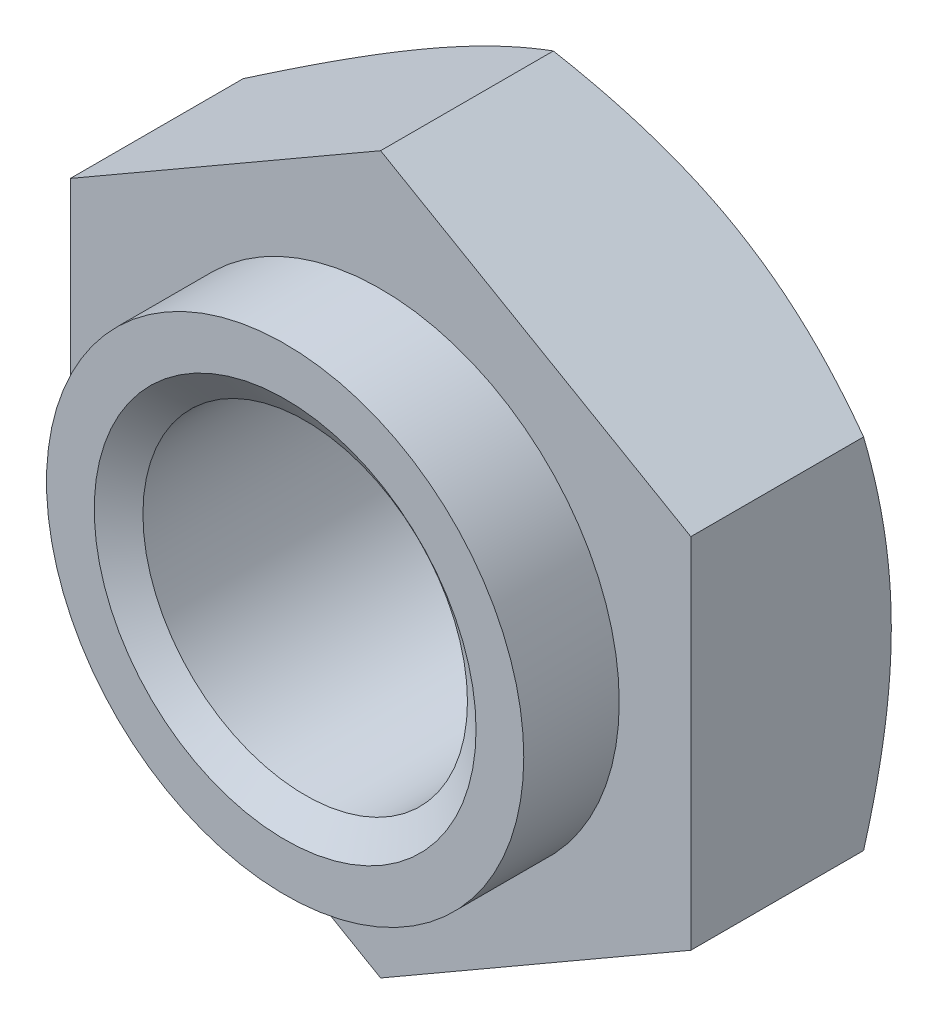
ISO-10303-21;
HEADER;
FILE_DESCRIPTION(('STEP AP214'),'2;1');
FILE_NAME('part.step','',(''),(''),'','','');
FILE_SCHEMA(('AUTOMOTIVE_DESIGN { 1 0 10303 214 1 1 1 1 }'));
ENDSEC;
DATA;
#1=APPLICATION_CONTEXT('core data for automotive mechanical design processes');
#2=APPLICATION_PROTOCOL_DEFINITION('international standard','automotive_design',2000,#1);
#3=PRODUCT_CONTEXT('',#1,'mechanical');
#4=PRODUCT('Part','Part','',(#3));
#5=PRODUCT_RELATED_PRODUCT_CATEGORY('part','',(#4));
#6=PRODUCT_DEFINITION_FORMATION('','',#4);
#7=PRODUCT_DEFINITION_CONTEXT('part definition',#1,'design');
#8=PRODUCT_DEFINITION('design','',#6,#7);
#9=PRODUCT_DEFINITION_SHAPE('','',#8);
#10=(LENGTH_UNIT() NAMED_UNIT(*) SI_UNIT(.MILLI.,.METRE.));
#11=(NAMED_UNIT(*) PLANE_ANGLE_UNIT() SI_UNIT($,.RADIAN.));
#12=(NAMED_UNIT(*) SI_UNIT($,.STERADIAN.) SOLID_ANGLE_UNIT());
#13=UNCERTAINTY_MEASURE_WITH_UNIT(LENGTH_MEASURE(1.E-05),#10,'distance_accuracy_value','');
#14=(GEOMETRIC_REPRESENTATION_CONTEXT(3) GLOBAL_UNCERTAINTY_ASSIGNED_CONTEXT((#13)) GLOBAL_UNIT_ASSIGNED_CONTEXT((#10,
#11,#12)) REPRESENTATION_CONTEXT('',''));
#15=CARTESIAN_POINT('',(0.,0.,0.));
#16=DIRECTION('',(0.,0.,1.));
#17=DIRECTION('',(1.,0.,0.));
#18=AXIS2_PLACEMENT_3D('',#15,#16,#17);
#19=CARTESIAN_POINT('',(0.,7.50555349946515,0.));
#20=DIRECTION('',(0.,0.,-1.));
#21=DIRECTION('',(-1.,0.,0.));
#22=AXIS2_PLACEMENT_3D('',#19,#20,#21);
#23=PLANE('',#22);
#24=CARTESIAN_POINT('',(0.,0.,0.));
#25=DIRECTION('',(0.,0.,1.));
#26=DIRECTION('',(1.,0.,0.));
#27=AXIS2_PLACEMENT_3D('',#24,#25,#26);
#28=CIRCLE('',#27,4.);
#29=CARTESIAN_POINT('',(4.,0.,0.));
#30=VERTEX_POINT('',#29);
#31=EDGE_CURVE('E146',#30,#30,#28,.T.);
#32=ORIENTED_EDGE('',*,*,#31,.F.);
#33=EDGE_LOOP('',(#32));
#34=FACE_BOUND('',#33,.T.);
#35=CARTESIAN_POINT('',(0.,0.,0.));
#36=DIRECTION('',(0.,0.,1.));
#37=DIRECTION('',(1.,0.,0.));
#38=AXIS2_PLACEMENT_3D('',#35,#36,#37);
#39=CIRCLE('',#38,5.);
#40=CARTESIAN_POINT('',(5.,0.,0.));
#41=VERTEX_POINT('',#40);
#42=EDGE_CURVE('E248',#41,#41,#39,.T.);
#43=ORIENTED_EDGE('',*,*,#42,.T.);
#44=EDGE_LOOP('',(#43));
#45=FACE_BOUND('',#44,.T.);
#46=ADVANCED_FACE('F35',(#34,#45),#23,.F.);
#47=CARTESIAN_POINT('',(0.,7.50555349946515,-6.2));
#48=DIRECTION('',(-0.500000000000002,0.866025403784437,0.));
#49=DIRECTION('',(-0.866025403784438,-0.500000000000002,0.));
#50=AXIS2_PLACEMENT_3D('',#47,#48,#49);
#51=PLANE('',#50);
#52=DIRECTION('',(0.,0.,1.));
#53=VECTOR('',#52,1.);
#54=CARTESIAN_POINT('',(-6.5,3.75277674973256,-6.2));
#55=LINE('',#54,#53);
#56=CARTESIAN_POINT('',(-6.5,3.7527767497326,-5.61944341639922));
#57=VERTEX_POINT('',#56);
#58=CARTESIAN_POINT('',(-6.5,3.75277674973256,-2.));
#59=VERTEX_POINT('',#58);
#60=EDGE_CURVE('E129',#57,#59,#55,.T.);
#61=ORIENTED_EDGE('',*,*,#60,.T.);
#62=DIRECTION('',(0.866025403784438,0.500000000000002,0.));
#63=VECTOR('',#62,1.);
#64=CARTESIAN_POINT('',(0.,7.50555349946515,-2.));
#65=LINE('',#64,#63);
#66=CARTESIAN_POINT('',(0.,7.50555349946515,-2.));
#67=VERTEX_POINT('',#66);
#68=EDGE_CURVE('E51',#59,#67,#65,.T.);
#69=ORIENTED_EDGE('',*,*,#68,.T.);
#70=DIRECTION('',(0.,0.,1.));
#71=VECTOR('',#70,1.);
#72=CARTESIAN_POINT('',(0.,7.50555349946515,-6.2));
#73=LINE('',#72,#71);
#74=CARTESIAN_POINT('',(0.,7.50555349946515,-5.61944341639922));
#75=VERTEX_POINT('',#74);
#76=EDGE_CURVE('E141',#75,#67,#73,.T.);
#77=ORIENTED_EDGE('',*,*,#76,.F.);
#78=CARTESIAN_POINT('',(-6.5002,3.75266127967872,-5.61937674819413));
#79=CARTESIAN_POINT('',(-6.35732254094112,3.83515161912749,-5.66699557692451));
#80=CARTESIAN_POINT('',(-6.21391236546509,3.91794952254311,-5.71245329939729));
#81=CARTESIAN_POINT('',(-5.9259273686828,4.08421773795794,-5.79845131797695));
#82=CARTESIAN_POINT('',(-5.78135207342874,4.16768832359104,-5.83898949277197));
#83=CARTESIAN_POINT('',(-5.34531134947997,4.41943655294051,-5.95242899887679));
#84=CARTESIAN_POINT('',(-5.05212471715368,4.58870793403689,-6.01695219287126));
#85=CARTESIAN_POINT('',(-4.61337625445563,4.84201947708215,-6.09261341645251));
#86=CARTESIAN_POINT('',(-4.46912536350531,4.92530276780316,-6.11416714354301));
#87=CARTESIAN_POINT('',(-4.17997178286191,5.09224566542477,-6.15030968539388));
#88=CARTESIAN_POINT('',(-4.03506915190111,5.17590523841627,-6.16489911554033));
#89=CARTESIAN_POINT('',(-3.74501222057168,5.34336968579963,-6.18674124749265));
#90=CARTESIAN_POINT('',(-3.59985839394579,5.427174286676,-6.19400227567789));
#91=CARTESIAN_POINT('',(-3.30942466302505,5.59485627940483,-6.20103969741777));
#92=CARTESIAN_POINT('',(-3.16414476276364,5.6787336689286,-6.2008163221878));
#93=CARTESIAN_POINT('',(-2.76612405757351,5.90853103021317,-6.18991654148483));
#94=CARTESIAN_POINT('',(-2.51351353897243,6.05437578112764,-6.17161818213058));
#95=CARTESIAN_POINT('',(-2.00997032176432,6.34509659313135,-6.11359365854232));
#96=CARTESIAN_POINT('',(-1.75903939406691,6.48997163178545,-6.07384766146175));
#97=CARTESIAN_POINT('',(-1.25448277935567,6.78127752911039,-5.97449409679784));
#98=CARTESIAN_POINT('',(-1.00092075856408,6.92767163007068,-5.91446557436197));
#99=CARTESIAN_POINT('',(-0.497578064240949,7.21827667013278,-5.77822500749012));
#100=CARTESIAN_POINT('',(-0.247790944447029,7.3624913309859,-5.7020449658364));
#101=CARTESIAN_POINT('',(0.000200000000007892,7.50566896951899,-5.61937674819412));
#102=B_SPLINE_CURVE_WITH_KNOTS('',3,(#78,#79,#80,#81,#82,#83,#84,#85,#86,#87,#88,#89,#90,#91,
#92,#93,#94,#95,#96,#97,#98,#99,#100,#101),.UNSPECIFIED.,.F.,.F.,(4,2,2,2,2,2,2,2,2,2,2,4),(0.,
0.515105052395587,1.03043143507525,2.06322554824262,2.56697389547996,3.07067772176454,
3.57380860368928,4.0769239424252,4.95279354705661,5.82947446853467,6.72559912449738,
7.61996451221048),.UNSPECIFIED.);
#103=CARTESIAN_POINT('',(-3.25000000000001,5.62916512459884,-6.2));
#104=VERTEX_POINT('',#103);
#105=EDGE_CURVE('E133',#104,#75,#102,.T.);
#106=ORIENTED_EDGE('',*,*,#105,.F.);
#107=EDGE_CURVE('E206',#57,#104,#102,.T.);
#108=ORIENTED_EDGE('',*,*,#107,.F.);
#109=EDGE_LOOP('',(#61,#69,#77,#106,#108));
#110=FACE_BOUND('',#109,.T.);
#111=ADVANCED_FACE('F37',(#110),#51,.T.);
#112=CARTESIAN_POINT('',(6.5,3.75277674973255,-6.2));
#113=DIRECTION('',(0.500000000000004,0.866025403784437,0.));
#114=DIRECTION('',(-0.866025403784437,0.500000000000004,0.));
#115=AXIS2_PLACEMENT_3D('',#112,#113,#114);
#116=PLANE('',#115);
#117=ORIENTED_EDGE('',*,*,#76,.T.);
#118=DIRECTION('',(0.866025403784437,-0.500000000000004,0.));
#119=VECTOR('',#118,1.);
#120=CARTESIAN_POINT('',(6.5,3.75277674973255,-2.));
#121=LINE('',#120,#119);
#122=CARTESIAN_POINT('',(6.5,3.75277674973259,-2.));
#123=VERTEX_POINT('',#122);
#124=EDGE_CURVE('E257',#67,#123,#121,.T.);
#125=ORIENTED_EDGE('',*,*,#124,.T.);
#126=DIRECTION('',(0.,0.,1.));
#127=VECTOR('',#126,1.);
#128=CARTESIAN_POINT('',(6.5,3.75277674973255,-6.2));
#129=LINE('',#128,#127);
#130=CARTESIAN_POINT('',(6.5,3.75277674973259,-5.61944341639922));
#131=VERTEX_POINT('',#130);
#132=EDGE_CURVE('E430',#131,#123,#129,.T.);
#133=ORIENTED_EDGE('',*,*,#132,.F.);
#134=CARTESIAN_POINT('',(-0.000199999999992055,7.50566896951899,-5.61937674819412));
#135=CARTESIAN_POINT('',(0.142677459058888,7.42317863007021,-5.6669955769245));
#136=CARTESIAN_POINT('',(0.286087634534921,7.34038072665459,-5.71245329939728));
#137=CARTESIAN_POINT('',(0.574072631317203,7.17411251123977,-5.79845131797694));
#138=CARTESIAN_POINT('',(0.718647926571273,7.09064192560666,-5.83898949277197));
#139=CARTESIAN_POINT('',(1.15468865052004,6.8388936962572,-5.95242899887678));
#140=CARTESIAN_POINT('',(1.44787528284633,6.66962231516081,-6.01695219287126));
#141=CARTESIAN_POINT('',(1.88662374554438,6.41631077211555,-6.0926134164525));
#142=CARTESIAN_POINT('',(2.0308746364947,6.33302748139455,-6.11416714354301));
#143=CARTESIAN_POINT('',(2.3200282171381,6.16608458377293,-6.15030968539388));
#144=CARTESIAN_POINT('',(2.4649308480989,6.08242501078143,-6.16489911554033));
#145=CARTESIAN_POINT('',(2.75498777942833,5.91496056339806,-6.18674124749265));
#146=CARTESIAN_POINT('',(2.90014160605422,5.8311559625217,-6.19400227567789));
#147=CARTESIAN_POINT('',(3.19057533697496,5.66347396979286,-6.20103969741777));
#148=CARTESIAN_POINT('',(3.33585523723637,5.5795965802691,-6.2008163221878));
#149=CARTESIAN_POINT('',(3.7338759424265,5.34979921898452,-6.18991654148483));
#150=CARTESIAN_POINT('',(3.98648646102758,5.20395446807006,-6.17161818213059));
#151=CARTESIAN_POINT('',(4.49002967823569,4.91323365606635,-6.11359365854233));
#152=CARTESIAN_POINT('',(4.74096060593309,4.76835861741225,-6.07384766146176));
#153=CARTESIAN_POINT('',(5.24551722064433,4.4770527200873,-5.97449409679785));
#154=CARTESIAN_POINT('',(5.49907924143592,4.33065861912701,-5.91446557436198));
#155=CARTESIAN_POINT('',(6.00242193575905,4.04005357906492,-5.77822500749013));
#156=CARTESIAN_POINT('',(6.25220905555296,3.8958389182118,-5.70204496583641));
#157=CARTESIAN_POINT('',(6.5002,3.75266127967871,-5.61937674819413));
#158=B_SPLINE_CURVE_WITH_KNOTS('',3,(#134,#135,#136,#137,#138,#139,#140,#141,#142,#143,#144,
#145,#146,#147,#148,#149,#150,#151,#152,#153,#154,#155,#156,#157),.UNSPECIFIED.,.F.,.F.,(4,2,2,
2,2,2,2,2,2,2,2,4),(0.,0.515105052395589,1.03043143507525,2.06322554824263,2.56697389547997,
3.07067772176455,3.57380860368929,4.07692394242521,4.95279354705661,5.82947446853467,
6.72559912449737,7.61996451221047),.UNSPECIFIED.);
#159=CARTESIAN_POINT('',(3.25000000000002,5.62916512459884,-6.2));
#160=VERTEX_POINT('',#159);
#161=EDGE_CURVE('E212',#160,#131,#158,.T.);
#162=ORIENTED_EDGE('',*,*,#161,.F.);
#163=EDGE_CURVE('E218',#75,#160,#158,.T.);
#164=ORIENTED_EDGE('',*,*,#163,.F.);
#165=EDGE_LOOP('',(#117,#125,#133,#162,#164));
#166=FACE_BOUND('',#165,.T.);
#167=ADVANCED_FACE('F220',(#166),#116,.T.);
#168=CARTESIAN_POINT('',(6.5,3.75277674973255,-6.2));
#169=DIRECTION('',(-1.,0.,0.));
#170=DIRECTION('',(0.,0.,1.));
#171=AXIS2_PLACEMENT_3D('',#168,#169,#170);
#172=PLANE('',#171);
#173=DIRECTION('',(0.,1.,0.));
#174=VECTOR('',#173,1.);
#175=CARTESIAN_POINT('',(6.5,3.75277674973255,-2.));
#176=LINE('',#175,#174);
#177=CARTESIAN_POINT('',(6.5,-3.7527767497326,-2.));
#178=VERTEX_POINT('',#177);
#179=EDGE_CURVE('E255',#178,#123,#176,.T.);
#180=ORIENTED_EDGE('',*,*,#179,.F.);
#181=DIRECTION('',(0.,0.,1.));
#182=VECTOR('',#181,1.);
#183=CARTESIAN_POINT('',(6.5,-3.7527767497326,-6.2));
#184=LINE('',#183,#182);
#185=CARTESIAN_POINT('',(6.5,-3.7527767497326,-5.61944341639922));
#186=VERTEX_POINT('',#185);
#187=EDGE_CURVE('E131',#186,#178,#184,.T.);
#188=ORIENTED_EDGE('',*,*,#187,.F.);
#189=CARTESIAN_POINT('',(6.5,-9.95291698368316,-3.08957641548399));
#190=CARTESIAN_POINT('',(6.5,-9.66753022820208,-3.22749106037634));
#191=CARTESIAN_POINT('',(6.5,-9.38146872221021,-3.36403471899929));
#192=CARTESIAN_POINT('',(6.5,-8.80763137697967,-3.63359663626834));
#193=CARTESIAN_POINT('',(6.5,-8.51985525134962,-3.76661428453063));
#194=CARTESIAN_POINT('',(6.5,-7.94066929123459,-4.02904149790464));
#195=CARTESIAN_POINT('',(6.5,-7.64924808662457,-4.15842605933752));
#196=CARTESIAN_POINT('',(6.5,-7.06401043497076,-4.41163779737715));
#197=CARTESIAN_POINT('',(6.5,-6.77019411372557,-4.53546526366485));
#198=CARTESIAN_POINT('',(6.5,-6.1760515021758,-4.77755519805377));
#199=CARTESIAN_POINT('',(6.5,-5.87568957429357,-4.89573068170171));
#200=CARTESIAN_POINT('',(6.5,-5.27142269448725,-5.12282610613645));
#201=CARTESIAN_POINT('',(6.5,-4.96751735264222,-5.231745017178));
#202=CARTESIAN_POINT('',(6.5,-4.35630541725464,-5.43740097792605));
#203=CARTESIAN_POINT('',(6.5,-4.04900762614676,-5.53416392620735));
#204=CARTESIAN_POINT('',(6.5,-3.43004022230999,-5.71236428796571));
#205=CARTESIAN_POINT('',(6.5,-3.11837202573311,-5.79380654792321));
#206=CARTESIAN_POINT('',(6.5,-2.49046594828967,-5.93741591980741));
#207=CARTESIAN_POINT('',(6.5,-2.17422687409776,-5.99957789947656));
#208=CARTESIAN_POINT('',(6.5,-1.53789167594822,-6.10042577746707));
#209=CARTESIAN_POINT('',(6.5,-1.21779554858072,-6.13911165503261));
#210=CARTESIAN_POINT('',(6.5,-0.737141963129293,-6.177053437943));
#211=CARTESIAN_POINT('',(6.5,-0.577336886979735,-6.18635478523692));
#212=CARTESIAN_POINT('',(6.5,-0.257468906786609,-6.19818591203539));
#213=CARTESIAN_POINT('',(6.5,-0.0974060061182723,-6.20071577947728));
#214=CARTESIAN_POINT('',(6.5,0.222635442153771,-6.19893598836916));
#215=CARTESIAN_POINT('',(6.5,0.382614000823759,-6.19462824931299));
#216=CARTESIAN_POINT('',(6.5,0.70225063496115,-6.17928241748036));
#217=CARTESIAN_POINT('',(6.5,0.861908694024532,-6.16824398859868));
#218=CARTESIAN_POINT('',(6.5,1.24887053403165,-6.13356313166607));
#219=CARTESIAN_POINT('',(6.5,1.47587694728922,-6.10654812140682));
#220=CARTESIAN_POINT('',(6.5,1.92815030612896,-6.04041011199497));
#221=CARTESIAN_POINT('',(6.5,2.15341675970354,-6.0012838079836));
#222=CARTESIAN_POINT('',(6.5,2.60202427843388,-5.9123108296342));
#223=CARTESIAN_POINT('',(6.5,2.82536331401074,-5.86245401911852));
#224=CARTESIAN_POINT('',(6.5,3.26974354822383,-5.75354123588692));
#225=CARTESIAN_POINT('',(6.5,3.49078496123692,-5.69448612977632));
#226=CARTESIAN_POINT('',(6.5,3.93601414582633,-5.56704588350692));
#227=CARTESIAN_POINT('',(6.5,4.16014622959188,-5.49846752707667));
#228=CARTESIAN_POINT('',(6.5,4.60604131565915,-5.35453487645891));
#229=CARTESIAN_POINT('',(6.5,4.82780583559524,-5.27918525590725));
#230=CARTESIAN_POINT('',(6.5,5.26807593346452,-5.12326649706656));
#231=CARTESIAN_POINT('',(6.5,5.48659282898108,-5.04272912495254));
#232=CARTESIAN_POINT('',(6.5,5.92193123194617,-4.87692729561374));
#233=CARTESIAN_POINT('',(6.5,6.13875201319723,-4.79166092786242));
#234=CARTESIAN_POINT('',(6.5,6.35478510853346,-4.70449786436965));
#235=B_SPLINE_CURVE_WITH_KNOTS('',3,(#189,#190,#191,#192,#193,#194,#195,#196,#197,#198,#199,
#200,#201,#202,#203,#204,#205,#206,#207,#208,#209,#210,#211,#212,#213,#214,#215,#216,#217,#218,
#219,#220,#221,#222,#223,#224,#225,#226,#227,#228,#229,#230,#231,#232,#233,#234),.UNSPECIFIED.,
.F.,.F.,(4,2,2,2,2,2,2,2,2,2,2,2,2,2,2,2,2,2,2,2,2,2,4),(0.,0.950904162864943,1.90197187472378,
2.85848216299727,3.81494253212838,4.78314526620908,5.75145556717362,6.71766655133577,
7.6835713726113,8.64973308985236,9.61589566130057,10.0960003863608,10.5760988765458,
11.0560626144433,11.5360503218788,12.2214931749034,12.9071232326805,13.5934038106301,
14.2796197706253,14.9826563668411,15.6852113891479,16.3838119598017,17.082696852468),.UNSPECIFIED.);
#236=CARTESIAN_POINT('',(6.5,0.,-6.2));
#237=VERTEX_POINT('',#236);
#238=EDGE_CURVE('E200',#186,#237,#235,.T.);
#239=ORIENTED_EDGE('',*,*,#238,.T.);
#240=EDGE_CURVE('E211',#237,#131,#235,.T.);
#241=ORIENTED_EDGE('',*,*,#240,.T.);
#242=ORIENTED_EDGE('',*,*,#132,.T.);
#243=EDGE_LOOP('',(#180,#188,#239,#241,#242));
#244=FACE_BOUND('',#243,.T.);
#245=ADVANCED_FACE('F224',(#244),#172,.F.);
#246=CARTESIAN_POINT('',(0.,-7.50555349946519,-6.2));
#247=DIRECTION('',(0.500000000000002,-0.866025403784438,0.));
#248=DIRECTION('',(0.866025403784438,0.500000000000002,0.));
#249=AXIS2_PLACEMENT_3D('',#246,#247,#248);
#250=PLANE('',#249);
#251=ORIENTED_EDGE('',*,*,#187,.T.);
#252=DIRECTION('',(-0.866025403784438,-0.500000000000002,0.));
#253=VECTOR('',#252,1.);
#254=CARTESIAN_POINT('',(0.,-7.50555349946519,-2.));
#255=LINE('',#254,#253);
#256=CARTESIAN_POINT('',(0.,-7.50555349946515,-2.));
#257=VERTEX_POINT('',#256);
#258=EDGE_CURVE('E121',#178,#257,#255,.T.);
#259=ORIENTED_EDGE('',*,*,#258,.T.);
#260=DIRECTION('',(0.,0.,1.));
#261=VECTOR('',#260,1.);
#262=CARTESIAN_POINT('',(0.,-7.50555349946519,-6.2));
#263=LINE('',#262,#261);
#264=CARTESIAN_POINT('',(0.,-7.50555349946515,-5.61944341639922));
#265=VERTEX_POINT('',#264);
#266=EDGE_CURVE('E120',#265,#257,#263,.T.);
#267=ORIENTED_EDGE('',*,*,#266,.F.);
#268=CARTESIAN_POINT('',(6.5002,-3.75266127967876,-5.61937674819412));
#269=CARTESIAN_POINT('',(6.35732254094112,-3.83515161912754,-5.6669955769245));
#270=CARTESIAN_POINT('',(6.21391236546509,-3.91794952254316,-5.71245329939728));
#271=CARTESIAN_POINT('',(5.92592736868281,-4.08421773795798,-5.79845131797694));
#272=CARTESIAN_POINT('',(5.78135207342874,-4.16768832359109,-5.83898949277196));
#273=CARTESIAN_POINT('',(5.34531134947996,-4.41943655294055,-5.95242899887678));
#274=CARTESIAN_POINT('',(5.05212471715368,-4.58870793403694,-6.01695219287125));
#275=CARTESIAN_POINT('',(4.61337625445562,-4.84201947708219,-6.09261341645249));
#276=CARTESIAN_POINT('',(4.4691253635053,-4.9253027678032,-6.114167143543));
#277=CARTESIAN_POINT('',(4.17997178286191,-5.09224566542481,-6.15030968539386));
#278=CARTESIAN_POINT('',(4.0350691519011,-5.17590523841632,-6.16489911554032));
#279=CARTESIAN_POINT('',(3.74501222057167,-5.34336968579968,-6.18674124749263));
#280=CARTESIAN_POINT('',(3.59985839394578,-5.42717428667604,-6.19400227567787));
#281=CARTESIAN_POINT('',(3.30942466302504,-5.59485627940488,-6.20103969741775));
#282=CARTESIAN_POINT('',(3.16414476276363,-5.67873366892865,-6.20081632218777));
#283=CARTESIAN_POINT('',(2.7661240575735,-5.90853103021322,-6.18991654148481));
#284=CARTESIAN_POINT('',(2.51351353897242,-6.05437578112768,-6.17161818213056));
#285=CARTESIAN_POINT('',(2.00997032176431,-6.3450965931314,-6.1135936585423));
#286=CARTESIAN_POINT('',(1.75903939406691,-6.48997163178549,-6.07384766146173));
#287=CARTESIAN_POINT('',(1.25448277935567,-6.78127752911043,-5.97449409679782));
#288=CARTESIAN_POINT('',(1.00092075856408,-6.92767163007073,-5.91446557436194));
#289=CARTESIAN_POINT('',(0.497578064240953,-7.21827667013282,-5.7782250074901));
#290=CARTESIAN_POINT('',(0.247790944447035,-7.36249133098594,-5.70204496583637));
#291=CARTESIAN_POINT('',(-0.000200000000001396,-7.50566896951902,-5.6193767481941));
#292=B_SPLINE_CURVE_WITH_KNOTS('',3,(#268,#269,#270,#271,#272,#273,#274,#275,#276,#277,#278,
#279,#280,#281,#282,#283,#284,#285,#286,#287,#288,#289,#290,#291),.UNSPECIFIED.,.F.,.F.,(4,2,2,
2,2,2,2,2,2,2,2,4),(0.,0.51510505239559,1.03043143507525,2.06322554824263,2.56697389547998,
3.07067772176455,3.57380860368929,4.07692394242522,4.95279354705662,5.82947446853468,
6.72559912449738,7.61996451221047),.UNSPECIFIED.);
#293=CARTESIAN_POINT('',(3.25000000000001,-5.62916512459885,-6.2));
#294=VERTEX_POINT('',#293);
#295=EDGE_CURVE('E194',#294,#265,#292,.T.);
#296=ORIENTED_EDGE('',*,*,#295,.F.);
#297=EDGE_CURVE('E422',#186,#294,#292,.T.);
#298=ORIENTED_EDGE('',*,*,#297,.F.);
#299=EDGE_LOOP('',(#251,#259,#267,#296,#298));
#300=FACE_BOUND('',#299,.T.);
#301=ADVANCED_FACE('F229',(#300),#250,.T.);
#302=CARTESIAN_POINT('',(-6.5,-3.75277674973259,-6.2));
#303=DIRECTION('',(-0.500000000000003,-0.866025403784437,0.));
#304=DIRECTION('',(0.866025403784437,-0.500000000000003,0.));
#305=AXIS2_PLACEMENT_3D('',#302,#303,#304);
#306=PLANE('',#305);
#307=ORIENTED_EDGE('',*,*,#266,.T.);
#308=DIRECTION('',(-0.866025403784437,0.500000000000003,0.));
#309=VECTOR('',#308,1.);
#310=CARTESIAN_POINT('',(-6.5,-3.75277674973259,-2.));
#311=LINE('',#310,#309);
#312=CARTESIAN_POINT('',(-6.5,-3.7527767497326,-2.));
#313=VERTEX_POINT('',#312);
#314=EDGE_CURVE('E107',#257,#313,#311,.T.);
#315=ORIENTED_EDGE('',*,*,#314,.T.);
#316=DIRECTION('',(0.,0.,1.));
#317=VECTOR('',#316,1.);
#318=CARTESIAN_POINT('',(-6.5,-3.75277674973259,-6.2));
#319=LINE('',#318,#317);
#320=CARTESIAN_POINT('',(-6.5,-3.7527767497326,-5.61944341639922));
#321=VERTEX_POINT('',#320);
#322=EDGE_CURVE('E118',#321,#313,#319,.T.);
#323=ORIENTED_EDGE('',*,*,#322,.F.);
#324=CARTESIAN_POINT('',(0.00019999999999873,-7.50566896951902,-5.6193767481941));
#325=CARTESIAN_POINT('',(-0.142677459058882,-7.42317863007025,-5.66699557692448));
#326=CARTESIAN_POINT('',(-0.286087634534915,-7.34038072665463,-5.71245329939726));
#327=CARTESIAN_POINT('',(-0.574072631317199,-7.1741125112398,-5.79845131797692));
#328=CARTESIAN_POINT('',(-0.718647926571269,-7.0906419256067,-5.83898949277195));
#329=CARTESIAN_POINT('',(-1.15468865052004,-6.83889369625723,-5.95242899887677));
#330=CARTESIAN_POINT('',(-1.44787528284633,-6.66962231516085,-6.01695219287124));
#331=CARTESIAN_POINT('',(-1.88662374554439,-6.41631077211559,-6.09261341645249));
#332=CARTESIAN_POINT('',(-2.0308746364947,-6.33302748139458,-6.11416714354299));
#333=CARTESIAN_POINT('',(-2.3200282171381,-6.16608458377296,-6.15030968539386));
#334=CARTESIAN_POINT('',(-2.4649308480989,-6.08242501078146,-6.16489911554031));
#335=CARTESIAN_POINT('',(-2.75498777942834,-5.91496056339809,-6.18674124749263));
#336=CARTESIAN_POINT('',(-2.90014160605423,-5.83115596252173,-6.19400227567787));
#337=CARTESIAN_POINT('',(-3.19057533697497,-5.66347396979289,-6.20103969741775));
#338=CARTESIAN_POINT('',(-3.33585523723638,-5.57959658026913,-6.20081632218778));
#339=CARTESIAN_POINT('',(-3.73387594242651,-5.34979921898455,-6.18991654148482));
#340=CARTESIAN_POINT('',(-3.98648646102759,-5.20395446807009,-6.17161818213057));
#341=CARTESIAN_POINT('',(-4.49002967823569,-4.91323365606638,-6.11359365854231));
#342=CARTESIAN_POINT('',(-4.74096060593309,-4.76835861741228,-6.07384766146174));
#343=CARTESIAN_POINT('',(-5.24551722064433,-4.47705272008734,-5.97449409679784));
#344=CARTESIAN_POINT('',(-5.49907924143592,-4.33065861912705,-5.91446557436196));
#345=CARTESIAN_POINT('',(-6.00242193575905,-4.04005357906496,-5.77822500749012));
#346=CARTESIAN_POINT('',(-6.25220905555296,-3.89583891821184,-5.7020449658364));
#347=CARTESIAN_POINT('',(-6.5002,-3.75266127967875,-5.61937674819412));
#348=B_SPLINE_CURVE_WITH_KNOTS('',3,(#324,#325,#326,#327,#328,#329,#330,#331,#332,#333,#334,
#335,#336,#337,#338,#339,#340,#341,#342,#343,#344,#345,#346,#347),.UNSPECIFIED.,.F.,.F.,(4,2,2,
2,2,2,2,2,2,2,2,4),(0.,0.515105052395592,1.03043143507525,2.06322554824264,2.56697389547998,
3.07067772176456,3.57380860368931,4.07692394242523,4.95279354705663,5.82947446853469,
6.72559912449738,7.61996451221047),.UNSPECIFIED.);
#349=CARTESIAN_POINT('',(-3.25000000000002,-5.62916512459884,-6.2));
#350=VERTEX_POINT('',#349);
#351=EDGE_CURVE('E169',#350,#321,#348,.T.);
#352=ORIENTED_EDGE('',*,*,#351,.F.);
#353=EDGE_CURVE('E58',#265,#350,#348,.T.);
#354=ORIENTED_EDGE('',*,*,#353,.F.);
#355=EDGE_LOOP('',(#307,#315,#323,#352,#354));
#356=FACE_BOUND('',#355,.T.);
#357=ADVANCED_FACE('F116',(#356),#306,.T.);
#358=CARTESIAN_POINT('',(-6.5,3.75277674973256,-6.2));
#359=DIRECTION('',(-1.,0.,0.));
#360=DIRECTION('',(0.,0.,1.));
#361=AXIS2_PLACEMENT_3D('',#358,#359,#360);
#362=PLANE('',#361);
#363=ORIENTED_EDGE('',*,*,#322,.T.);
#364=DIRECTION('',(0.,1.,0.));
#365=VECTOR('',#364,1.);
#366=CARTESIAN_POINT('',(-6.5,3.75277674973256,-2.));
#367=LINE('',#366,#365);
#368=EDGE_CURVE('E11',#313,#59,#367,.T.);
#369=ORIENTED_EDGE('',*,*,#368,.T.);
#370=ORIENTED_EDGE('',*,*,#60,.F.);
#371=CARTESIAN_POINT('',(-6.5,-9.95291698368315,-3.089576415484));
#372=CARTESIAN_POINT('',(-6.5,-9.66753022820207,-3.22749106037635));
#373=CARTESIAN_POINT('',(-6.5,-9.38146872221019,-3.3640347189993));
#374=CARTESIAN_POINT('',(-6.5,-8.80763137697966,-3.63359663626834));
#375=CARTESIAN_POINT('',(-6.5,-8.51985525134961,-3.76661428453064));
#376=CARTESIAN_POINT('',(-6.5,-7.94066929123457,-4.02904149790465));
#377=CARTESIAN_POINT('',(-6.5,-7.64924808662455,-4.15842605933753));
#378=CARTESIAN_POINT('',(-6.5,-7.06401043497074,-4.41163779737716));
#379=CARTESIAN_POINT('',(-6.5,-6.77019411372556,-4.53546526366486));
#380=CARTESIAN_POINT('',(-6.5,-6.17605150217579,-4.77755519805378));
#381=CARTESIAN_POINT('',(-6.5,-5.87568957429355,-4.89573068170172));
#382=CARTESIAN_POINT('',(-6.5,-5.27142269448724,-5.12282610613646));
#383=CARTESIAN_POINT('',(-6.5,-4.96751735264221,-5.23174501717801));
#384=CARTESIAN_POINT('',(-6.5,-4.35630541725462,-5.43740097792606));
#385=CARTESIAN_POINT('',(-6.5,-4.04900762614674,-5.53416392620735));
#386=CARTESIAN_POINT('',(-6.5,-3.43004022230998,-5.71236428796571));
#387=CARTESIAN_POINT('',(-6.5,-3.1183720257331,-5.79380654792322));
#388=CARTESIAN_POINT('',(-6.5,-2.49046594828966,-5.93741591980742));
#389=CARTESIAN_POINT('',(-6.5,-2.17422687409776,-5.99957789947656));
#390=CARTESIAN_POINT('',(-6.5,-1.53789167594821,-6.10042577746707));
#391=CARTESIAN_POINT('',(-6.5,-1.21779554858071,-6.13911165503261));
#392=CARTESIAN_POINT('',(-6.5,-0.737141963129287,-6.177053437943));
#393=CARTESIAN_POINT('',(-6.5,-0.577336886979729,-6.18635478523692));
#394=CARTESIAN_POINT('',(-6.5,-0.257468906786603,-6.19818591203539));
#395=CARTESIAN_POINT('',(-6.5,-0.0974060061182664,-6.20071577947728));
#396=CARTESIAN_POINT('',(-6.5,0.222635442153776,-6.19893598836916));
#397=CARTESIAN_POINT('',(-6.5,0.382614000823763,-6.194628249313));
#398=CARTESIAN_POINT('',(-6.5,0.702250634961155,-6.17928241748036));
#399=CARTESIAN_POINT('',(-6.5,0.861908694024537,-6.16824398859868));
#400=CARTESIAN_POINT('',(-6.5,1.24887053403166,-6.13356313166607));
#401=CARTESIAN_POINT('',(-6.5,1.47587694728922,-6.10654812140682));
#402=CARTESIAN_POINT('',(-6.5,1.92815030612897,-6.04041011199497));
#403=CARTESIAN_POINT('',(-6.5,2.15341675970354,-6.0012838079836));
#404=CARTESIAN_POINT('',(-6.5,2.60202427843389,-5.9123108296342));
#405=CARTESIAN_POINT('',(-6.5,2.82536331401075,-5.86245401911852));
#406=CARTESIAN_POINT('',(-6.5,3.26974354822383,-5.75354123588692));
#407=CARTESIAN_POINT('',(-6.5,3.49078496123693,-5.69448612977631));
#408=CARTESIAN_POINT('',(-6.5,3.93601414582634,-5.56704588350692));
#409=CARTESIAN_POINT('',(-6.5,4.16014622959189,-5.49846752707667));
#410=CARTESIAN_POINT('',(-6.5,4.60604131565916,-5.35453487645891));
#411=CARTESIAN_POINT('',(-6.5,4.82780583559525,-5.27918525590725));
#412=CARTESIAN_POINT('',(-6.5,5.26807593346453,-5.12326649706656));
#413=CARTESIAN_POINT('',(-6.5,5.48659282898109,-5.04272912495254));
#414=CARTESIAN_POINT('',(-6.5,5.92193123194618,-4.87692729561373));
#415=CARTESIAN_POINT('',(-6.5,6.13875201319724,-4.79166092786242));
#416=CARTESIAN_POINT('',(-6.5,6.35478510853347,-4.70449786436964));
#417=B_SPLINE_CURVE_WITH_KNOTS('',3,(#371,#372,#373,#374,#375,#376,#377,#378,#379,#380,#381,
#382,#383,#384,#385,#386,#387,#388,#389,#390,#391,#392,#393,#394,#395,#396,#397,#398,#399,#400,
#401,#402,#403,#404,#405,#406,#407,#408,#409,#410,#411,#412,#413,#414,#415,#416),.UNSPECIFIED.,
.F.,.F.,(4,2,2,2,2,2,2,2,2,2,2,2,2,2,2,2,2,2,2,2,2,2,4),(0.,0.950904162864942,1.90197187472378,
2.85848216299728,3.81494253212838,4.78314526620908,5.75145556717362,6.71766655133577,
7.6835713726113,8.64973308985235,9.61589566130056,10.0960003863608,10.5760988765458,
11.0560626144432,11.5360503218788,12.2214931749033,12.9071232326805,13.5934038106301,
14.2796197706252,14.9826563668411,15.6852113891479,16.3838119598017,17.082696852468),.UNSPECIFIED.);
#418=CARTESIAN_POINT('',(-6.5,0.,-6.2));
#419=VERTEX_POINT('',#418);
#420=EDGE_CURVE('E163',#419,#57,#417,.T.);
#421=ORIENTED_EDGE('',*,*,#420,.F.);
#422=EDGE_CURVE('E128',#321,#419,#417,.T.);
#423=ORIENTED_EDGE('',*,*,#422,.F.);
#424=EDGE_LOOP('',(#363,#369,#370,#421,#423));
#425=FACE_BOUND('',#424,.T.);
#426=ADVANCED_FACE('F125',(#425),#362,.T.);
#427=CARTESIAN_POINT('',(0.,0.,-6.2));
#428=DIRECTION('',(0.,0.,1.));
#429=DIRECTION('',(1.,0.,0.));
#430=AXIS2_PLACEMENT_3D('',#427,#428,#429);
#431=CYLINDRICAL_SURFACE('',#430,3.4);
#432=CARTESIAN_POINT('',(0.,0.,-0.420124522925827));
#433=DIRECTION('',(0.,0.,1.));
#434=DIRECTION('',(1.,0.,0.));
#435=AXIS2_PLACEMENT_3D('',#432,#433,#434);
#436=CIRCLE('',#435,3.4);
#437=CARTESIAN_POINT('',(3.4,0.,-0.420124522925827));
#438=VERTEX_POINT('',#437);
#439=EDGE_CURVE('E142',#438,#438,#436,.F.);
#440=CARTESIAN_POINT('',(0.,0.,-5.75447547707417));
#441=DIRECTION('',(0.,0.,-1.));
#442=DIRECTION('',(-1.,0.,0.));
#443=AXIS2_PLACEMENT_3D('',#440,#441,#442);
#444=CIRCLE('',#443,3.4);
#445=CARTESIAN_POINT('',(3.4,0.,-5.75447547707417));
#446=VERTEX_POINT('',#445);
#447=EDGE_CURVE('E149',#446,#446,#444,.F.);
#448=CARTESIAN_POINT('',(3.4,0.,-0.420124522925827));
#449=CARTESIAN_POINT('',(3.4,0.,-0.475690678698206));
#450=CARTESIAN_POINT('',(3.4,0.,-0.531256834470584));
#451=CARTESIAN_POINT('',(3.4,0.,-0.642389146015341));
#452=CARTESIAN_POINT('',(3.4,0.,-0.69795530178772));
#453=CARTESIAN_POINT('',(3.4,0.,-0.809087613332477));
#454=CARTESIAN_POINT('',(3.4,0.,-0.864653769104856));
#455=CARTESIAN_POINT('',(3.4,0.,-0.975786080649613));
#456=CARTESIAN_POINT('',(3.4,0.,-1.03135223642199));
#457=CARTESIAN_POINT('',(3.4,0.,-1.14248454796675));
#458=CARTESIAN_POINT('',(3.4,0.,-1.19805070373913));
#459=CARTESIAN_POINT('',(3.4,0.,-1.30918301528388));
#460=CARTESIAN_POINT('',(3.4,0.,-1.36474917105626));
#461=CARTESIAN_POINT('',(3.4,0.,-1.47588148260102));
#462=CARTESIAN_POINT('',(3.4,0.,-1.5314476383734));
#463=CARTESIAN_POINT('',(3.4,0.,-1.64257994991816));
#464=CARTESIAN_POINT('',(3.4,0.,-1.69814610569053));
#465=CARTESIAN_POINT('',(3.4,0.,-1.80927841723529));
#466=CARTESIAN_POINT('',(3.4,0.,-1.86484457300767));
#467=CARTESIAN_POINT('',(3.4,0.,-1.97597688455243));
#468=CARTESIAN_POINT('',(3.4,0.,-2.03154304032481));
#469=CARTESIAN_POINT('',(3.4,0.,-2.14267535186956));
#470=CARTESIAN_POINT('',(3.4,0.,-2.19824150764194));
#471=CARTESIAN_POINT('',(3.4,0.,-2.3093738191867));
#472=CARTESIAN_POINT('',(3.4,0.,-2.36493997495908));
#473=CARTESIAN_POINT('',(3.4,0.,-2.47607228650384));
#474=CARTESIAN_POINT('',(3.4,0.,-2.53163844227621));
#475=CARTESIAN_POINT('',(3.4,0.,-2.64277075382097));
#476=CARTESIAN_POINT('',(3.4,0.,-2.69833690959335));
#477=CARTESIAN_POINT('',(3.4,0.,-2.80946922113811));
#478=CARTESIAN_POINT('',(3.4,0.,-2.86503537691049));
#479=CARTESIAN_POINT('',(3.4,0.,-2.97616768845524));
#480=CARTESIAN_POINT('',(3.4,0.,-3.03173384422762));
#481=CARTESIAN_POINT('',(3.4,0.,-3.14286615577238));
#482=CARTESIAN_POINT('',(3.4,0.,-3.19843231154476));
#483=CARTESIAN_POINT('',(3.4,0.,-3.30956462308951));
#484=CARTESIAN_POINT('',(3.4,0.,-3.36513077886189));
#485=CARTESIAN_POINT('',(3.4,0.,-3.47626309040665));
#486=CARTESIAN_POINT('',(3.4,0.,-3.53182924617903));
#487=CARTESIAN_POINT('',(3.4,0.,-3.64296155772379));
#488=CARTESIAN_POINT('',(3.4,0.,-3.69852771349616));
#489=CARTESIAN_POINT('',(3.4,0.,-3.80966002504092));
#490=CARTESIAN_POINT('',(3.4,0.,-3.8652261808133));
#491=CARTESIAN_POINT('',(3.4,0.,-3.97635849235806));
#492=CARTESIAN_POINT('',(3.4,0.,-4.03192464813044));
#493=CARTESIAN_POINT('',(3.4,0.,-4.14305695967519));
#494=CARTESIAN_POINT('',(3.4,0.,-4.19862311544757));
#495=CARTESIAN_POINT('',(3.4,0.,-4.30975542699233));
#496=CARTESIAN_POINT('',(3.4,0.,-4.36532158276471));
#497=CARTESIAN_POINT('',(3.4,0.,-4.47645389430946));
#498=CARTESIAN_POINT('',(3.4,0.,-4.53202005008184));
#499=CARTESIAN_POINT('',(3.4,0.,-4.6431523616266));
#500=CARTESIAN_POINT('',(3.4,0.,-4.69871851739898));
#501=CARTESIAN_POINT('',(3.4,0.,-4.80985082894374));
#502=CARTESIAN_POINT('',(3.4,0.,-4.86541698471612));
#503=CARTESIAN_POINT('',(3.4,0.,-4.97654929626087));
#504=CARTESIAN_POINT('',(3.4,0.,-5.03211545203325));
#505=CARTESIAN_POINT('',(3.4,0.,-5.14324776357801));
#506=CARTESIAN_POINT('',(3.4,0.,-5.19881391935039));
#507=CARTESIAN_POINT('',(3.4,0.,-5.30994623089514));
#508=CARTESIAN_POINT('',(3.4,0.,-5.36551238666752));
#509=CARTESIAN_POINT('',(3.4,0.,-5.47664469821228));
#510=CARTESIAN_POINT('',(3.4,0.,-5.53221085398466));
#511=CARTESIAN_POINT('',(3.4,0.,-5.64334316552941));
#512=CARTESIAN_POINT('',(3.4,0.,-5.69890932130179));
#513=CARTESIAN_POINT('',(3.4,0.,-5.75447547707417));
#514=B_SPLINE_CURVE_WITH_KNOTS('',3,(#448,#449,#450,#451,#452,#453,#454,#455,#456,#457,#458,
#459,#460,#461,#462,#463,#464,#465,#466,#467,#468,#469,#470,#471,#472,#473,#474,#475,#476,#477,
#478,#479,#480,#481,#482,#483,#484,#485,#486,#487,#488,#489,#490,#491,#492,#493,#494,#495,#496,
#497,#498,#499,#500,#501,#502,#503,#504,#505,#506,#507,#508,#509,#510,#511,#512,#513),
.UNSPECIFIED.,.F.,.F.,(4,2,2,2,2,2,2,2,2,2,2,2,2,2,2,2,2,2,2,2,2,2,2,2,2,2,2,2,2,2,2,2,4),(0.,
0.166698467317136,0.333396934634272,0.500095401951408,0.666793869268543,0.833492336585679,
1.00019080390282,1.16688927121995,1.33358773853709,1.50028620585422,1.66698467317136,
1.83368314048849,2.00038160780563,2.16708007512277,2.3337785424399,2.50047700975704,
2.66717547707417,2.83387394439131,3.00057241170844,3.16727087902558,3.33396934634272,
3.50066781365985,3.66736628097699,3.83406474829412,4.00076321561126,4.1674616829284,
4.33416015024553,4.50085861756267,4.6675570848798,4.83425555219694,5.00095401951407,
5.16765248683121,5.33435095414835),.UNSPECIFIED.);
#515=EDGE_CURVE('BSEAM186',#438,#446,#514,.T.);
#516=ORIENTED_EDGE('',*,*,#439,.F.);
#517=ORIENTED_EDGE('',*,*,#447,.F.);
#518=ORIENTED_EDGE('',*,*,#515,.T.);
#519=ORIENTED_EDGE('',*,*,#515,.F.);
#520=EDGE_LOOP('',(#516,#518,#517,#519));
#521=FACE_BOUND('',#520,.T.);
#522=ADVANCED_FACE('F186',(#521),#431,.F.);
#523=CARTESIAN_POINT('',(0.,7.50555349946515,-6.2));
#524=DIRECTION('',(0.,0.,-1.));
#525=DIRECTION('',(-1.,0.,0.));
#526=AXIS2_PLACEMENT_3D('',#523,#524,#525);
#527=PLANE('',#526);
#528=CARTESIAN_POINT('',(0.,0.,-6.2));
#529=DIRECTION('',(0.,0.,-1.));
#530=DIRECTION('',(-1.,0.,0.));
#531=AXIS2_PLACEMENT_3D('',#528,#529,#530);
#532=CIRCLE('',#531,6.5);
#533=EDGE_CURVE('E44',#419,#350,#532,.F.);
#534=ORIENTED_EDGE('',*,*,#533,.F.);
#535=EDGE_CURVE('E137',#104,#419,#532,.F.);
#536=ORIENTED_EDGE('',*,*,#535,.F.);
#537=EDGE_CURVE('E140',#160,#104,#532,.F.);
#538=ORIENTED_EDGE('',*,*,#537,.F.);
#539=CARTESIAN_POINT('',(0.,0.,-6.2));
#540=DIRECTION('',(0.,0.,1.));
#541=DIRECTION('',(1.,0.,0.));
#542=AXIS2_PLACEMENT_3D('',#539,#540,#541);
#543=CIRCLE('',#542,6.5);
#544=EDGE_CURVE('E145',#237,#160,#543,.T.);
#545=ORIENTED_EDGE('',*,*,#544,.F.);
#546=EDGE_CURVE('E440',#294,#237,#532,.F.);
#547=ORIENTED_EDGE('',*,*,#546,.F.);
#548=EDGE_CURVE('E419',#350,#294,#532,.F.);
#549=ORIENTED_EDGE('',*,*,#548,.F.);
#550=EDGE_LOOP('',(#534,#536,#538,#545,#547,#549));
#551=FACE_BOUND('',#550,.T.);
#552=CARTESIAN_POINT('',(0.,0.,-6.2));
#553=DIRECTION('',(0.,0.,-1.));
#554=DIRECTION('',(-1.,0.,0.));
#555=AXIS2_PLACEMENT_3D('',#552,#553,#554);
#556=CIRCLE('',#555,4.);
#557=CARTESIAN_POINT('',(-4.,0.,-6.2));
#558=VERTEX_POINT('',#557);
#559=EDGE_CURVE('E147',#558,#558,#556,.F.);
#560=ORIENTED_EDGE('',*,*,#559,.T.);
#561=EDGE_LOOP('',(#560));
#562=FACE_BOUND('',#561,.T.);
#563=ADVANCED_FACE('F226',(#551,#562),#527,.T.);
#564=CARTESIAN_POINT('',(0.,0.,-6.2));
#565=DIRECTION('',(0.,0.,1.));
#566=DIRECTION('',(1.,0.,0.));
#567=AXIS2_PLACEMENT_3D('',#564,#565,#566);
#568=CONICAL_SURFACE('',#567,6.5,1.0471975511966);
#569=ORIENTED_EDGE('',*,*,#107,.T.);
#570=ORIENTED_EDGE('',*,*,#535,.T.);
#571=ORIENTED_EDGE('',*,*,#420,.T.);
#572=EDGE_LOOP('',(#569,#570,#571));
#573=FACE_BOUND('',#572,.T.);
#574=ADVANCED_FACE('F357',(#573),#568,.T.);
#575=ORIENTED_EDGE('',*,*,#105,.T.);
#576=ORIENTED_EDGE('',*,*,#163,.T.);
#577=ORIENTED_EDGE('',*,*,#537,.T.);
#578=EDGE_LOOP('',(#575,#576,#577));
#579=FACE_BOUND('',#578,.T.);
#580=ADVANCED_FACE('F184',(#579),#568,.T.);
#581=ORIENTED_EDGE('',*,*,#161,.T.);
#582=ORIENTED_EDGE('',*,*,#240,.F.);
#583=ORIENTED_EDGE('',*,*,#544,.T.);
#584=EDGE_LOOP('',(#581,#582,#583));
#585=FACE_BOUND('',#584,.T.);
#586=ADVANCED_FACE('F371',(#585),#568,.T.);
#587=ORIENTED_EDGE('',*,*,#297,.T.);
#588=ORIENTED_EDGE('',*,*,#546,.T.);
#589=ORIENTED_EDGE('',*,*,#238,.F.);
#590=EDGE_LOOP('',(#587,#588,#589));
#591=FACE_BOUND('',#590,.T.);
#592=ADVANCED_FACE('F365',(#591),#568,.T.);
#593=ORIENTED_EDGE('',*,*,#295,.T.);
#594=ORIENTED_EDGE('',*,*,#353,.T.);
#595=ORIENTED_EDGE('',*,*,#548,.T.);
#596=EDGE_LOOP('',(#593,#594,#595));
#597=FACE_BOUND('',#596,.T.);
#598=ADVANCED_FACE('F182',(#597),#568,.T.);
#599=ORIENTED_EDGE('',*,*,#351,.T.);
#600=ORIENTED_EDGE('',*,*,#422,.T.);
#601=ORIENTED_EDGE('',*,*,#533,.T.);
#602=EDGE_LOOP('',(#599,#600,#601));
#603=FACE_BOUND('',#602,.T.);
#604=ADVANCED_FACE('F176',(#603),#568,.T.);
#605=CARTESIAN_POINT('',(0.,0.,-0.462136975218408));
#606=DIRECTION('',(0.,0.,1.));
#607=DIRECTION('',(1.,0.,0.));
#608=AXIS2_PLACEMENT_3D('',#605,#606,#607);
#609=CONICAL_SURFACE('',#608,3.34,0.959931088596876);
#610=ORIENTED_EDGE('',*,*,#31,.T.);
#611=EDGE_LOOP('',(#610));
#612=FACE_BOUND('',#611,.T.);
#613=ORIENTED_EDGE('',*,*,#439,.T.);
#614=EDGE_LOOP('',(#613));
#615=FACE_BOUND('',#614,.T.);
#616=ADVANCED_FACE('F181',(#612,#615),#609,.F.);
#617=CARTESIAN_POINT('',(0.,0.,-6.1746));
#618=DIRECTION('',(0.,0.,-1.));
#619=DIRECTION('',(-1.,0.,0.));
#620=AXIS2_PLACEMENT_3D('',#617,#618,#619);
#621=CONICAL_SURFACE('',#620,4.,0.959931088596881);
#622=CARTESIAN_POINT('',(0.,0.,-6.1746));
#623=DIRECTION('',(0.,0.,1.));
#624=DIRECTION('',(1.,0.,0.));
#625=AXIS2_PLACEMENT_3D('',#622,#623,#624);
#626=CIRCLE('',#625,4.);
#627=CARTESIAN_POINT('',(4.,0.,-6.1746));
#628=VERTEX_POINT('',#627);
#629=EDGE_CURVE('E150',#628,#628,#626,.T.);
#630=ORIENTED_EDGE('',*,*,#629,.F.);
#631=EDGE_LOOP('',(#630));
#632=FACE_BOUND('',#631,.T.);
#633=ORIENTED_EDGE('',*,*,#447,.T.);
#634=EDGE_LOOP('',(#633));
#635=FACE_BOUND('',#634,.T.);
#636=ADVANCED_FACE('F266',(#632,#635),#621,.F.);
#637=CARTESIAN_POINT('',(0.,0.,-25.0375057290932));
#638=DIRECTION('',(0.,0.,1.));
#639=DIRECTION('',(1.,0.,0.));
#640=AXIS2_PLACEMENT_3D('',#637,#638,#639);
#641=CYLINDRICAL_SURFACE('',#640,4.);
#642=ORIENTED_EDGE('',*,*,#559,.F.);
#643=EDGE_LOOP('',(#642));
#644=FACE_BOUND('',#643,.T.);
#645=ORIENTED_EDGE('',*,*,#629,.T.);
#646=EDGE_LOOP('',(#645));
#647=FACE_BOUND('',#646,.T.);
#648=ADVANCED_FACE('F264',(#644,#647),#641,.F.);
#649=CARTESIAN_POINT('',(0.,0.,-2.));
#650=DIRECTION('',(0.,0.,1.));
#651=DIRECTION('',(1.,0.,0.));
#652=AXIS2_PLACEMENT_3D('',#649,#650,#651);
#653=PLANE('',#652);
#654=ORIENTED_EDGE('',*,*,#368,.F.);
#655=ORIENTED_EDGE('',*,*,#314,.F.);
#656=ORIENTED_EDGE('',*,*,#258,.F.);
#657=ORIENTED_EDGE('',*,*,#179,.T.);
#658=ORIENTED_EDGE('',*,*,#124,.F.);
#659=ORIENTED_EDGE('',*,*,#68,.F.);
#660=EDGE_LOOP('',(#654,#655,#656,#657,#658,#659));
#661=FACE_BOUND('',#660,.T.);
#662=CARTESIAN_POINT('',(0.,0.,-2.));
#663=DIRECTION('',(0.,0.,1.));
#664=DIRECTION('',(1.,0.,0.));
#665=AXIS2_PLACEMENT_3D('',#662,#663,#664);
#666=CIRCLE('',#665,5.);
#667=CARTESIAN_POINT('',(5.,0.,-2.));
#668=VERTEX_POINT('',#667);
#669=EDGE_CURVE('E122',#668,#668,#666,.T.);
#670=ORIENTED_EDGE('',*,*,#669,.F.);
#671=EDGE_LOOP('',(#670));
#672=FACE_BOUND('',#671,.T.);
#673=ADVANCED_FACE('F105',(#661,#672),#653,.T.);
#674=CARTESIAN_POINT('',(0.,0.,-2.));
#675=DIRECTION('',(0.,0.,1.));
#676=DIRECTION('',(1.,0.,0.));
#677=AXIS2_PLACEMENT_3D('',#674,#675,#676);
#678=CYLINDRICAL_SURFACE('',#677,5.);
#679=ORIENTED_EDGE('',*,*,#669,.T.);
#680=EDGE_LOOP('',(#679));
#681=FACE_BOUND('',#680,.T.);
#682=ORIENTED_EDGE('',*,*,#42,.F.);
#683=EDGE_LOOP('',(#682));
#684=FACE_BOUND('',#683,.T.);
#685=ADVANCED_FACE('F277',(#681,#684),#678,.T.);
#686=CLOSED_SHELL('',(#46,#111,#167,#245,#301,#357,#426,#522,#563,#574,#580,#586,#592,#598,#604,
#616,#636,#648,#673,#685));
#687=MANIFOLD_SOLID_BREP('B2',#686);
#688=ADVANCED_BREP_SHAPE_REPRESENTATION('',(#18,#687),#14);
#689=SHAPE_DEFINITION_REPRESENTATION(#9,#688);
ENDSEC;
END-ISO-10303-21;
